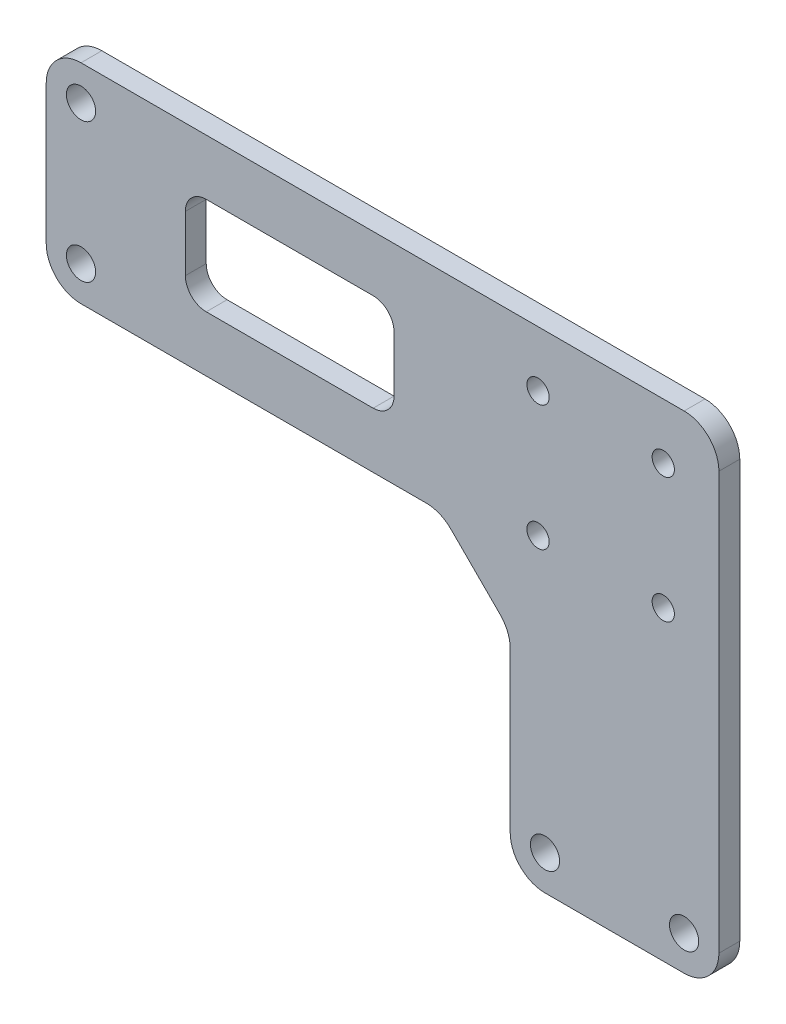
ISO-10303-21;
HEADER;
FILE_DESCRIPTION(('STEP AP214'),'2;1');
FILE_NAME('part.step','',(''),(''),'','','');
FILE_SCHEMA(('AUTOMOTIVE_DESIGN { 1 0 10303 214 1 1 1 1 }'));
ENDSEC;
DATA;
#1=APPLICATION_CONTEXT('core data for automotive mechanical design processes');
#2=APPLICATION_PROTOCOL_DEFINITION('international standard','automotive_design',2000,#1);
#3=PRODUCT_CONTEXT('',#1,'mechanical');
#4=PRODUCT('Part','Part','',(#3));
#5=PRODUCT_RELATED_PRODUCT_CATEGORY('part','',(#4));
#6=PRODUCT_DEFINITION_FORMATION('','',#4);
#7=PRODUCT_DEFINITION_CONTEXT('part definition',#1,'design');
#8=PRODUCT_DEFINITION('design','',#6,#7);
#9=PRODUCT_DEFINITION_SHAPE('','',#8);
#10=(LENGTH_UNIT() NAMED_UNIT(*) SI_UNIT(.MILLI.,.METRE.));
#11=(NAMED_UNIT(*) PLANE_ANGLE_UNIT() SI_UNIT($,.RADIAN.));
#12=(NAMED_UNIT(*) SI_UNIT($,.STERADIAN.) SOLID_ANGLE_UNIT());
#13=UNCERTAINTY_MEASURE_WITH_UNIT(LENGTH_MEASURE(1.E-05),#10,'distance_accuracy_value','');
#14=(GEOMETRIC_REPRESENTATION_CONTEXT(3) GLOBAL_UNCERTAINTY_ASSIGNED_CONTEXT((#13)) GLOBAL_UNIT_ASSIGNED_CONTEXT((#10,
#11,#12)) REPRESENTATION_CONTEXT('',''));
#15=CARTESIAN_POINT('',(0.,0.,0.));
#16=DIRECTION('',(0.,0.,1.));
#17=DIRECTION('',(1.,0.,0.));
#18=AXIS2_PLACEMENT_3D('',#15,#16,#17);
#19=CARTESIAN_POINT('',(0.,0.,3.));
#20=DIRECTION('',(0.,0.,-1.));
#21=DIRECTION('',(-1.,0.,0.));
#22=AXIS2_PLACEMENT_3D('',#19,#20,#21);
#23=PLANE('',#22);
#24=CARTESIAN_POINT('',(88.7000000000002,4.,3.));
#25=DIRECTION('',(0.,0.,1.));
#26=DIRECTION('',(1.,0.,0.));
#27=AXIS2_PLACEMENT_3D('',#24,#25,#26);
#28=CIRCLE('',#27,1.60000000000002);
#29=CARTESIAN_POINT('',(90.3000000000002,4.,3.));
#30=VERTEX_POINT('',#29);
#31=EDGE_CURVE('E330',#30,#30,#28,.T.);
#32=ORIENTED_EDGE('',*,*,#31,.F.);
#33=EDGE_LOOP('',(#32));
#34=FACE_BOUND('',#33,.T.);
#35=CARTESIAN_POINT('',(91.7,-35.0000000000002,3.));
#36=DIRECTION('',(0.,0.,1.));
#37=DIRECTION('',(1.,0.,0.));
#38=AXIS2_PLACEMENT_3D('',#35,#36,#37);
#39=CIRCLE('',#38,2.1);
#40=CARTESIAN_POINT('',(93.8,-35.0000000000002,3.));
#41=VERTEX_POINT('',#40);
#42=EDGE_CURVE('E345',#41,#41,#39,.T.);
#43=ORIENTED_EDGE('',*,*,#42,.F.);
#44=EDGE_LOOP('',(#43));
#45=FACE_BOUND('',#44,.T.);
#46=CARTESIAN_POINT('',(71.7,-35.0000000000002,3.));
#47=DIRECTION('',(0.,0.,1.));
#48=DIRECTION('',(1.,0.,0.));
#49=AXIS2_PLACEMENT_3D('',#46,#47,#48);
#50=CIRCLE('',#49,2.09999999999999);
#51=CARTESIAN_POINT('',(73.8,-35.0000000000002,3.));
#52=VERTEX_POINT('',#51);
#53=EDGE_CURVE('E351',#52,#52,#50,.T.);
#54=ORIENTED_EDGE('',*,*,#53,.F.);
#55=EDGE_LOOP('',(#54));
#56=FACE_BOUND('',#55,.T.);
#57=CARTESIAN_POINT('',(5.,25.,3.));
#58=DIRECTION('',(0.,0.,1.));
#59=DIRECTION('',(1.,0.,0.));
#60=AXIS2_PLACEMENT_3D('',#57,#58,#59);
#61=CIRCLE('',#60,2.1);
#62=CARTESIAN_POINT('',(7.1,25.,3.));
#63=VERTEX_POINT('',#62);
#64=EDGE_CURVE('E357',#63,#63,#61,.T.);
#65=ORIENTED_EDGE('',*,*,#64,.F.);
#66=EDGE_LOOP('',(#65));
#67=FACE_BOUND('',#66,.T.);
#68=CARTESIAN_POINT('',(70.7000000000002,3.99999999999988,3.));
#69=DIRECTION('',(0.,0.,1.));
#70=DIRECTION('',(1.,0.,0.));
#71=AXIS2_PLACEMENT_3D('',#68,#69,#70);
#72=CIRCLE('',#71,1.60000000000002);
#73=CARTESIAN_POINT('',(72.3000000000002,3.99999999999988,3.));
#74=VERTEX_POINT('',#73);
#75=EDGE_CURVE('E363',#74,#74,#72,.T.);
#76=ORIENTED_EDGE('',*,*,#75,.F.);
#77=EDGE_LOOP('',(#76));
#78=FACE_BOUND('',#77,.T.);
#79=CARTESIAN_POINT('',(70.7,21.9999999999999,3.));
#80=DIRECTION('',(0.,0.,1.));
#81=DIRECTION('',(1.,0.,0.));
#82=AXIS2_PLACEMENT_3D('',#79,#80,#81);
#83=CIRCLE('',#82,1.6);
#84=CARTESIAN_POINT('',(72.3,21.9999999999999,3.));
#85=VERTEX_POINT('',#84);
#86=EDGE_CURVE('E369',#85,#85,#83,.T.);
#87=ORIENTED_EDGE('',*,*,#86,.F.);
#88=EDGE_LOOP('',(#87));
#89=FACE_BOUND('',#88,.T.);
#90=CARTESIAN_POINT('',(5.,5.,3.));
#91=DIRECTION('',(0.,0.,1.));
#92=DIRECTION('',(1.,0.,0.));
#93=AXIS2_PLACEMENT_3D('',#90,#91,#92);
#94=CIRCLE('',#93,2.1);
#95=CARTESIAN_POINT('',(7.1,5.,3.));
#96=VERTEX_POINT('',#95);
#97=EDGE_CURVE('E375',#96,#96,#94,.T.);
#98=ORIENTED_EDGE('',*,*,#97,.F.);
#99=EDGE_LOOP('',(#98));
#100=FACE_BOUND('',#99,.T.);
#101=CARTESIAN_POINT('',(88.7,22.,3.));
#102=DIRECTION('',(0.,0.,1.));
#103=DIRECTION('',(1.,0.,0.));
#104=AXIS2_PLACEMENT_3D('',#101,#102,#103);
#105=CIRCLE('',#104,1.60000000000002);
#106=CARTESIAN_POINT('',(90.3,22.,3.));
#107=VERTEX_POINT('',#106);
#108=EDGE_CURVE('E381',#107,#107,#105,.T.);
#109=ORIENTED_EDGE('',*,*,#108,.F.);
#110=EDGE_LOOP('',(#109));
#111=FACE_BOUND('',#110,.T.);
#112=DIRECTION('',(0.,1.,0.));
#113=VECTOR('',#112,1.);
#114=CARTESIAN_POINT('',(96.7,30.,3.));
#115=LINE('',#114,#113);
#116=CARTESIAN_POINT('',(96.7,-35.0000000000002,3.));
#117=VERTEX_POINT('',#116);
#118=CARTESIAN_POINT('',(96.7,25.,3.));
#119=VERTEX_POINT('',#118);
#120=EDGE_CURVE('E398',#117,#119,#115,.T.);
#121=ORIENTED_EDGE('',*,*,#120,.T.);
#122=CARTESIAN_POINT('',(91.7,25.,3.));
#123=DIRECTION('',(0.,0.,-1.));
#124=DIRECTION('',(-1.,0.,0.));
#125=AXIS2_PLACEMENT_3D('',#122,#123,#124);
#126=CIRCLE('',#125,5.);
#127=CARTESIAN_POINT('',(91.7,30.,3.));
#128=VERTEX_POINT('',#127);
#129=EDGE_CURVE('E240',#119,#128,#126,.F.);
#130=ORIENTED_EDGE('',*,*,#129,.T.);
#131=DIRECTION('',(-1.,0.,0.));
#132=VECTOR('',#131,1.);
#133=CARTESIAN_POINT('',(0.,30.,3.));
#134=LINE('',#133,#132);
#135=CARTESIAN_POINT('',(5.,30.,3.));
#136=VERTEX_POINT('',#135);
#137=EDGE_CURVE('E204',#128,#136,#134,.T.);
#138=ORIENTED_EDGE('',*,*,#137,.T.);
#139=CARTESIAN_POINT('',(5.,25.,3.));
#140=DIRECTION('',(0.,0.,-1.));
#141=DIRECTION('',(-1.,0.,0.));
#142=AXIS2_PLACEMENT_3D('',#139,#140,#141);
#143=CIRCLE('',#142,5.);
#144=CARTESIAN_POINT('',(0.,25.,3.));
#145=VERTEX_POINT('',#144);
#146=EDGE_CURVE('E234',#136,#145,#143,.F.);
#147=ORIENTED_EDGE('',*,*,#146,.T.);
#148=DIRECTION('',(0.,-1.,0.));
#149=VECTOR('',#148,1.);
#150=CARTESIAN_POINT('',(0.,0.,3.));
#151=LINE('',#150,#149);
#152=CARTESIAN_POINT('',(0.,5.,3.));
#153=VERTEX_POINT('',#152);
#154=EDGE_CURVE('E222',#145,#153,#151,.T.);
#155=ORIENTED_EDGE('',*,*,#154,.T.);
#156=CARTESIAN_POINT('',(5.,5.,3.));
#157=DIRECTION('',(0.,0.,-1.));
#158=DIRECTION('',(-1.,0.,0.));
#159=AXIS2_PLACEMENT_3D('',#156,#157,#158);
#160=CIRCLE('',#159,5.);
#161=CARTESIAN_POINT('',(5.00000000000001,0.,3.));
#162=VERTEX_POINT('',#161);
#163=EDGE_CURVE('E232',#153,#162,#160,.F.);
#164=ORIENTED_EDGE('',*,*,#163,.T.);
#165=DIRECTION('',(1.,0.,0.));
#166=VECTOR('',#165,1.);
#167=CARTESIAN_POINT('',(56.7,0.,3.));
#168=LINE('',#167,#166);
#169=CARTESIAN_POINT('',(54.6289321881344,0.,3.));
#170=VERTEX_POINT('',#169);
#171=EDGE_CURVE('E216',#162,#170,#168,.T.);
#172=ORIENTED_EDGE('',*,*,#171,.T.);
#173=CARTESIAN_POINT('',(54.6289321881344,-5.,3.));
#174=DIRECTION('',(0.,0.,-1.));
#175=DIRECTION('',(-1.,0.,0.));
#176=AXIS2_PLACEMENT_3D('',#173,#174,#175);
#177=CIRCLE('',#176,5.);
#178=CARTESIAN_POINT('',(58.1644660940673,-1.46446609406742,3.));
#179=VERTEX_POINT('',#178);
#180=EDGE_CURVE('E269',#170,#179,#177,.T.);
#181=ORIENTED_EDGE('',*,*,#180,.T.);
#182=DIRECTION('',(0.707106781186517,-0.707106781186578,0.));
#183=VECTOR('',#182,1.);
#184=CARTESIAN_POINT('',(66.6999999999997,-10.0000000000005,3.));
#185=LINE('',#184,#183);
#186=CARTESIAN_POINT('',(65.2355339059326,-8.53553390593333,3.));
#187=VERTEX_POINT('',#186);
#188=EDGE_CURVE('E389',#179,#187,#185,.T.);
#189=ORIENTED_EDGE('',*,*,#188,.T.);
#190=CARTESIAN_POINT('',(61.6999999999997,-12.0710678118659,3.));
#191=DIRECTION('',(0.,0.,-1.));
#192=DIRECTION('',(-1.,0.,0.));
#193=AXIS2_PLACEMENT_3D('',#190,#191,#192);
#194=CIRCLE('',#193,5.);
#195=CARTESIAN_POINT('',(66.6999999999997,-12.0710678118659,3.));
#196=VERTEX_POINT('',#195);
#197=EDGE_CURVE('E273',#187,#196,#194,.T.);
#198=ORIENTED_EDGE('',*,*,#197,.T.);
#199=DIRECTION('',(0.,-1.,0.));
#200=VECTOR('',#199,1.);
#201=CARTESIAN_POINT('',(66.7,-40.0000000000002,3.));
#202=LINE('',#201,#200);
#203=CARTESIAN_POINT('',(66.7,-35.0000000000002,3.));
#204=VERTEX_POINT('',#203);
#205=EDGE_CURVE('E392',#196,#204,#202,.T.);
#206=ORIENTED_EDGE('',*,*,#205,.T.);
#207=CARTESIAN_POINT('',(71.7,-35.0000000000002,3.));
#208=DIRECTION('',(0.,0.,-1.));
#209=DIRECTION('',(-1.,0.,0.));
#210=AXIS2_PLACEMENT_3D('',#207,#208,#209);
#211=CIRCLE('',#210,5.);
#212=CARTESIAN_POINT('',(71.7,-40.0000000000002,3.));
#213=VERTEX_POINT('',#212);
#214=EDGE_CURVE('E236',#204,#213,#211,.F.);
#215=ORIENTED_EDGE('',*,*,#214,.T.);
#216=DIRECTION('',(1.,0.,0.));
#217=VECTOR('',#216,1.);
#218=CARTESIAN_POINT('',(96.7,-40.0000000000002,3.));
#219=LINE('',#218,#217);
#220=CARTESIAN_POINT('',(91.7,-40.0000000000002,3.));
#221=VERTEX_POINT('',#220);
#222=EDGE_CURVE('E395',#213,#221,#219,.T.);
#223=ORIENTED_EDGE('',*,*,#222,.T.);
#224=CARTESIAN_POINT('',(91.7,-35.0000000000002,3.));
#225=DIRECTION('',(0.,0.,-1.));
#226=DIRECTION('',(-1.,0.,0.));
#227=AXIS2_PLACEMENT_3D('',#224,#225,#226);
#228=CIRCLE('',#227,5.);
#229=EDGE_CURVE('E238',#221,#117,#228,.F.);
#230=ORIENTED_EDGE('',*,*,#229,.T.);
#231=EDGE_LOOP('',(#121,#130,#138,#147,#155,#164,#172,#181,#189,#198,#206,#215,#223,#230));
#232=FACE_BOUND('',#231,.T.);
#233=DIRECTION('',(0.,1.,0.));
#234=VECTOR('',#233,1.);
#235=CARTESIAN_POINT('',(50.,8.,3.));
#236=LINE('',#235,#234);
#237=CARTESIAN_POINT('',(50.,11.,3.));
#238=VERTEX_POINT('',#237);
#239=CARTESIAN_POINT('',(50.,19.,3.));
#240=VERTEX_POINT('',#239);
#241=EDGE_CURVE('E322',#238,#240,#236,.T.);
#242=ORIENTED_EDGE('',*,*,#241,.F.);
#243=CARTESIAN_POINT('',(47.,11.,3.));
#244=DIRECTION('',(0.,0.,-1.));
#245=DIRECTION('',(-1.,0.,0.));
#246=AXIS2_PLACEMENT_3D('',#243,#244,#245);
#247=CIRCLE('',#246,3.);
#248=CARTESIAN_POINT('',(47.,8.,3.));
#249=VERTEX_POINT('',#248);
#250=EDGE_CURVE('E11',#238,#249,#247,.T.);
#251=ORIENTED_EDGE('',*,*,#250,.T.);
#252=DIRECTION('',(1.,0.,0.));
#253=VECTOR('',#252,1.);
#254=CARTESIAN_POINT('',(20.,8.,3.));
#255=LINE('',#254,#253);
#256=CARTESIAN_POINT('',(23.,8.,3.));
#257=VERTEX_POINT('',#256);
#258=EDGE_CURVE('E320',#257,#249,#255,.T.);
#259=ORIENTED_EDGE('',*,*,#258,.F.);
#260=CARTESIAN_POINT('',(23.,11.,3.));
#261=DIRECTION('',(0.,0.,-1.));
#262=DIRECTION('',(-1.,0.,0.));
#263=AXIS2_PLACEMENT_3D('',#260,#261,#262);
#264=CIRCLE('',#263,3.);
#265=CARTESIAN_POINT('',(20.,11.,3.));
#266=VERTEX_POINT('',#265);
#267=EDGE_CURVE('E296',#257,#266,#264,.T.);
#268=ORIENTED_EDGE('',*,*,#267,.T.);
#269=DIRECTION('',(0.,-1.,0.));
#270=VECTOR('',#269,1.);
#271=CARTESIAN_POINT('',(20.,8.,3.));
#272=LINE('',#271,#270);
#273=CARTESIAN_POINT('',(20.,19.,3.));
#274=VERTEX_POINT('',#273);
#275=EDGE_CURVE('E327',#274,#266,#272,.T.);
#276=ORIENTED_EDGE('',*,*,#275,.F.);
#277=CARTESIAN_POINT('',(23.,19.,3.));
#278=DIRECTION('',(0.,0.,-1.));
#279=DIRECTION('',(-1.,0.,0.));
#280=AXIS2_PLACEMENT_3D('',#277,#278,#279);
#281=CIRCLE('',#280,3.);
#282=CARTESIAN_POINT('',(23.,22.,3.));
#283=VERTEX_POINT('',#282);
#284=EDGE_CURVE('E300',#274,#283,#281,.T.);
#285=ORIENTED_EDGE('',*,*,#284,.T.);
#286=DIRECTION('',(-1.,0.,0.));
#287=VECTOR('',#286,1.);
#288=CARTESIAN_POINT('',(20.,22.,3.));
#289=LINE('',#288,#287);
#290=CARTESIAN_POINT('',(47.,22.,3.));
#291=VERTEX_POINT('',#290);
#292=EDGE_CURVE('E333',#291,#283,#289,.T.);
#293=ORIENTED_EDGE('',*,*,#292,.F.);
#294=CARTESIAN_POINT('',(47.,19.,3.));
#295=DIRECTION('',(0.,0.,-1.));
#296=DIRECTION('',(-1.,0.,0.));
#297=AXIS2_PLACEMENT_3D('',#294,#295,#296);
#298=CIRCLE('',#297,3.);
#299=EDGE_CURVE('E49',#291,#240,#298,.T.);
#300=ORIENTED_EDGE('',*,*,#299,.T.);
#301=EDGE_LOOP('',(#242,#251,#259,#268,#276,#285,#293,#300));
#302=FACE_BOUND('',#301,.T.);
#303=ADVANCED_FACE('F34',(#34,#45,#56,#67,#78,#89,#100,#111,#232,#302),#23,.F.);
#304=CARTESIAN_POINT('',(0.,0.,0.));
#305=DIRECTION('',(0.,0.,-1.));
#306=DIRECTION('',(-1.,0.,0.));
#307=AXIS2_PLACEMENT_3D('',#304,#305,#306);
#308=PLANE('',#307);
#309=CARTESIAN_POINT('',(91.7,-35.0000000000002,0.));
#310=DIRECTION('',(0.,0.,1.));
#311=DIRECTION('',(1.,0.,0.));
#312=AXIS2_PLACEMENT_3D('',#309,#310,#311);
#313=CIRCLE('',#312,2.1);
#314=CARTESIAN_POINT('',(93.8,-35.0000000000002,0.));
#315=VERTEX_POINT('',#314);
#316=EDGE_CURVE('E343',#315,#315,#313,.T.);
#317=ORIENTED_EDGE('',*,*,#316,.T.);
#318=EDGE_LOOP('',(#317));
#319=FACE_BOUND('',#318,.T.);
#320=CARTESIAN_POINT('',(5.,25.,0.));
#321=DIRECTION('',(0.,0.,1.));
#322=DIRECTION('',(1.,0.,0.));
#323=AXIS2_PLACEMENT_3D('',#320,#321,#322);
#324=CIRCLE('',#323,2.1);
#325=CARTESIAN_POINT('',(7.1,25.,0.));
#326=VERTEX_POINT('',#325);
#327=EDGE_CURVE('E354',#326,#326,#324,.T.);
#328=ORIENTED_EDGE('',*,*,#327,.T.);
#329=EDGE_LOOP('',(#328));
#330=FACE_BOUND('',#329,.T.);
#331=CARTESIAN_POINT('',(70.7,21.9999999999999,0.));
#332=DIRECTION('',(0.,0.,1.));
#333=DIRECTION('',(1.,0.,0.));
#334=AXIS2_PLACEMENT_3D('',#331,#332,#333);
#335=CIRCLE('',#334,1.6);
#336=CARTESIAN_POINT('',(72.3,21.9999999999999,0.));
#337=VERTEX_POINT('',#336);
#338=EDGE_CURVE('E366',#337,#337,#335,.T.);
#339=ORIENTED_EDGE('',*,*,#338,.T.);
#340=EDGE_LOOP('',(#339));
#341=FACE_BOUND('',#340,.T.);
#342=CARTESIAN_POINT('',(88.7,22.,0.));
#343=DIRECTION('',(0.,0.,1.));
#344=DIRECTION('',(1.,0.,0.));
#345=AXIS2_PLACEMENT_3D('',#342,#343,#344);
#346=CIRCLE('',#345,1.60000000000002);
#347=CARTESIAN_POINT('',(90.3,22.,0.));
#348=VERTEX_POINT('',#347);
#349=EDGE_CURVE('E378',#348,#348,#346,.T.);
#350=ORIENTED_EDGE('',*,*,#349,.T.);
#351=EDGE_LOOP('',(#350));
#352=FACE_BOUND('',#351,.T.);
#353=DIRECTION('',(-1.,0.,0.));
#354=VECTOR('',#353,1.);
#355=CARTESIAN_POINT('',(0.,30.,0.));
#356=LINE('',#355,#354);
#357=CARTESIAN_POINT('',(91.7,30.,0.));
#358=VERTEX_POINT('',#357);
#359=CARTESIAN_POINT('',(5.,30.,0.));
#360=VERTEX_POINT('',#359);
#361=EDGE_CURVE('E201',#358,#360,#356,.T.);
#362=ORIENTED_EDGE('',*,*,#361,.F.);
#363=CARTESIAN_POINT('',(91.7,25.,0.));
#364=DIRECTION('',(0.,0.,-1.));
#365=DIRECTION('',(-1.,0.,0.));
#366=AXIS2_PLACEMENT_3D('',#363,#364,#365);
#367=CIRCLE('',#366,5.);
#368=CARTESIAN_POINT('',(96.7,25.,0.));
#369=VERTEX_POINT('',#368);
#370=EDGE_CURVE('E184',#358,#369,#367,.T.);
#371=ORIENTED_EDGE('',*,*,#370,.T.);
#372=DIRECTION('',(0.,1.,0.));
#373=VECTOR('',#372,1.);
#374=CARTESIAN_POINT('',(96.7,30.,0.));
#375=LINE('',#374,#373);
#376=CARTESIAN_POINT('',(96.7,-35.0000000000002,0.));
#377=VERTEX_POINT('',#376);
#378=EDGE_CURVE('E213',#377,#369,#375,.T.);
#379=ORIENTED_EDGE('',*,*,#378,.F.);
#380=CARTESIAN_POINT('',(91.7,-35.0000000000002,0.));
#381=DIRECTION('',(0.,0.,-1.));
#382=DIRECTION('',(-1.,0.,0.));
#383=AXIS2_PLACEMENT_3D('',#380,#381,#382);
#384=CIRCLE('',#383,5.);
#385=CARTESIAN_POINT('',(91.7,-40.0000000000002,0.));
#386=VERTEX_POINT('',#385);
#387=EDGE_CURVE('E195',#377,#386,#384,.T.);
#388=ORIENTED_EDGE('',*,*,#387,.T.);
#389=DIRECTION('',(1.,0.,0.));
#390=VECTOR('',#389,1.);
#391=CARTESIAN_POINT('',(96.7,-40.0000000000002,0.));
#392=LINE('',#391,#390);
#393=CARTESIAN_POINT('',(71.7,-40.0000000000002,0.));
#394=VERTEX_POINT('',#393);
#395=EDGE_CURVE('E218',#394,#386,#392,.T.);
#396=ORIENTED_EDGE('',*,*,#395,.F.);
#397=CARTESIAN_POINT('',(71.7,-35.0000000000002,0.));
#398=DIRECTION('',(0.,0.,-1.));
#399=DIRECTION('',(-1.,0.,0.));
#400=AXIS2_PLACEMENT_3D('',#397,#398,#399);
#401=CIRCLE('',#400,5.);
#402=CARTESIAN_POINT('',(66.7,-35.0000000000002,0.));
#403=VERTEX_POINT('',#402);
#404=EDGE_CURVE('E226',#394,#403,#401,.T.);
#405=ORIENTED_EDGE('',*,*,#404,.T.);
#406=DIRECTION('',(0.,-1.,0.));
#407=VECTOR('',#406,1.);
#408=CARTESIAN_POINT('',(66.7,-40.0000000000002,0.));
#409=LINE('',#408,#407);
#410=CARTESIAN_POINT('',(66.6999999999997,-12.0710678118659,0.));
#411=VERTEX_POINT('',#410);
#412=EDGE_CURVE('E409',#411,#403,#409,.T.);
#413=ORIENTED_EDGE('',*,*,#412,.F.);
#414=CARTESIAN_POINT('',(61.6999999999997,-12.0710678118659,0.));
#415=DIRECTION('',(0.,0.,-1.));
#416=DIRECTION('',(-1.,0.,0.));
#417=AXIS2_PLACEMENT_3D('',#414,#415,#416);
#418=CIRCLE('',#417,5.);
#419=CARTESIAN_POINT('',(65.2355339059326,-8.53553390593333,0.));
#420=VERTEX_POINT('',#419);
#421=EDGE_CURVE('E271',#411,#420,#418,.F.);
#422=ORIENTED_EDGE('',*,*,#421,.T.);
#423=DIRECTION('',(0.707106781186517,-0.707106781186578,0.));
#424=VECTOR('',#423,1.);
#425=CARTESIAN_POINT('',(66.6999999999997,-10.0000000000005,0.));
#426=LINE('',#425,#424);
#427=CARTESIAN_POINT('',(58.1644660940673,-1.46446609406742,0.));
#428=VERTEX_POINT('',#427);
#429=EDGE_CURVE('E406',#428,#420,#426,.T.);
#430=ORIENTED_EDGE('',*,*,#429,.F.);
#431=CARTESIAN_POINT('',(54.6289321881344,-5.,0.));
#432=DIRECTION('',(0.,0.,-1.));
#433=DIRECTION('',(-1.,0.,0.));
#434=AXIS2_PLACEMENT_3D('',#431,#432,#433);
#435=CIRCLE('',#434,5.);
#436=CARTESIAN_POINT('',(54.6289321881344,0.,0.));
#437=VERTEX_POINT('',#436);
#438=EDGE_CURVE('E267',#428,#437,#435,.F.);
#439=ORIENTED_EDGE('',*,*,#438,.T.);
#440=DIRECTION('',(1.,0.,0.));
#441=VECTOR('',#440,1.);
#442=CARTESIAN_POINT('',(56.7,0.,0.));
#443=LINE('',#442,#441);
#444=CARTESIAN_POINT('',(5.00000000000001,0.,0.));
#445=VERTEX_POINT('',#444);
#446=EDGE_CURVE('E384',#445,#437,#443,.T.);
#447=ORIENTED_EDGE('',*,*,#446,.F.);
#448=CARTESIAN_POINT('',(5.,5.,0.));
#449=DIRECTION('',(0.,0.,-1.));
#450=DIRECTION('',(-1.,0.,0.));
#451=AXIS2_PLACEMENT_3D('',#448,#449,#450);
#452=CIRCLE('',#451,5.);
#453=CARTESIAN_POINT('',(0.,5.,0.));
#454=VERTEX_POINT('',#453);
#455=EDGE_CURVE('E205',#445,#454,#452,.T.);
#456=ORIENTED_EDGE('',*,*,#455,.T.);
#457=DIRECTION('',(0.,-1.,0.));
#458=VECTOR('',#457,1.);
#459=CARTESIAN_POINT('',(0.,0.,0.));
#460=LINE('',#459,#458);
#461=CARTESIAN_POINT('',(0.,25.,0.));
#462=VERTEX_POINT('',#461);
#463=EDGE_CURVE('E212',#462,#454,#460,.T.);
#464=ORIENTED_EDGE('',*,*,#463,.F.);
#465=CARTESIAN_POINT('',(5.,25.,0.));
#466=DIRECTION('',(0.,0.,-1.));
#467=DIRECTION('',(-1.,0.,0.));
#468=AXIS2_PLACEMENT_3D('',#465,#466,#467);
#469=CIRCLE('',#468,5.);
#470=EDGE_CURVE('E211',#462,#360,#469,.T.);
#471=ORIENTED_EDGE('',*,*,#470,.T.);
#472=EDGE_LOOP('',(#362,#371,#379,#388,#396,#405,#413,#422,#430,#439,#447,#456,#464,#471));
#473=FACE_BOUND('',#472,.T.);
#474=CARTESIAN_POINT('',(5.,5.,0.));
#475=DIRECTION('',(0.,0.,1.));
#476=DIRECTION('',(1.,0.,0.));
#477=AXIS2_PLACEMENT_3D('',#474,#475,#476);
#478=CIRCLE('',#477,2.1);
#479=CARTESIAN_POINT('',(7.1,5.,0.));
#480=VERTEX_POINT('',#479);
#481=EDGE_CURVE('E372',#480,#480,#478,.T.);
#482=ORIENTED_EDGE('',*,*,#481,.T.);
#483=EDGE_LOOP('',(#482));
#484=FACE_BOUND('',#483,.T.);
#485=CARTESIAN_POINT('',(70.7000000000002,3.99999999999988,0.));
#486=DIRECTION('',(0.,0.,1.));
#487=DIRECTION('',(1.,0.,0.));
#488=AXIS2_PLACEMENT_3D('',#485,#486,#487);
#489=CIRCLE('',#488,1.60000000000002);
#490=CARTESIAN_POINT('',(72.3000000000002,3.99999999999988,0.));
#491=VERTEX_POINT('',#490);
#492=EDGE_CURVE('E360',#491,#491,#489,.T.);
#493=ORIENTED_EDGE('',*,*,#492,.T.);
#494=EDGE_LOOP('',(#493));
#495=FACE_BOUND('',#494,.T.);
#496=CARTESIAN_POINT('',(71.7,-35.0000000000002,0.));
#497=DIRECTION('',(0.,0.,1.));
#498=DIRECTION('',(1.,0.,0.));
#499=AXIS2_PLACEMENT_3D('',#496,#497,#498);
#500=CIRCLE('',#499,2.09999999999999);
#501=CARTESIAN_POINT('',(73.8,-35.0000000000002,0.));
#502=VERTEX_POINT('',#501);
#503=EDGE_CURVE('E348',#502,#502,#500,.T.);
#504=ORIENTED_EDGE('',*,*,#503,.T.);
#505=EDGE_LOOP('',(#504));
#506=FACE_BOUND('',#505,.T.);
#507=CARTESIAN_POINT('',(88.7000000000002,4.,0.));
#508=DIRECTION('',(0.,0.,1.));
#509=DIRECTION('',(1.,0.,0.));
#510=AXIS2_PLACEMENT_3D('',#507,#508,#509);
#511=CIRCLE('',#510,1.60000000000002);
#512=CARTESIAN_POINT('',(90.3000000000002,4.,0.));
#513=VERTEX_POINT('',#512);
#514=EDGE_CURVE('E326',#513,#513,#511,.T.);
#515=ORIENTED_EDGE('',*,*,#514,.T.);
#516=EDGE_LOOP('',(#515));
#517=FACE_BOUND('',#516,.T.);
#518=DIRECTION('',(0.,-1.,0.));
#519=VECTOR('',#518,1.);
#520=CARTESIAN_POINT('',(20.,8.,0.));
#521=LINE('',#520,#519);
#522=CARTESIAN_POINT('',(20.,19.,0.));
#523=VERTEX_POINT('',#522);
#524=CARTESIAN_POINT('',(20.,11.,0.));
#525=VERTEX_POINT('',#524);
#526=EDGE_CURVE('E339',#523,#525,#521,.T.);
#527=ORIENTED_EDGE('',*,*,#526,.T.);
#528=CARTESIAN_POINT('',(23.,11.,0.));
#529=DIRECTION('',(0.,0.,-1.));
#530=DIRECTION('',(-1.,0.,0.));
#531=AXIS2_PLACEMENT_3D('',#528,#529,#530);
#532=CIRCLE('',#531,3.);
#533=CARTESIAN_POINT('',(23.,8.,0.));
#534=VERTEX_POINT('',#533);
#535=EDGE_CURVE('E294',#525,#534,#532,.F.);
#536=ORIENTED_EDGE('',*,*,#535,.T.);
#537=DIRECTION('',(1.,0.,0.));
#538=VECTOR('',#537,1.);
#539=CARTESIAN_POINT('',(20.,8.,0.));
#540=LINE('',#539,#538);
#541=CARTESIAN_POINT('',(47.,8.,0.));
#542=VERTEX_POINT('',#541);
#543=EDGE_CURVE('E310',#534,#542,#540,.T.);
#544=ORIENTED_EDGE('',*,*,#543,.T.);
#545=CARTESIAN_POINT('',(47.,11.,0.));
#546=DIRECTION('',(0.,0.,-1.));
#547=DIRECTION('',(-1.,0.,0.));
#548=AXIS2_PLACEMENT_3D('',#545,#546,#547);
#549=CIRCLE('',#548,3.);
#550=CARTESIAN_POINT('',(50.,11.,0.));
#551=VERTEX_POINT('',#550);
#552=EDGE_CURVE('E42',#542,#551,#549,.F.);
#553=ORIENTED_EDGE('',*,*,#552,.T.);
#554=DIRECTION('',(0.,1.,0.));
#555=VECTOR('',#554,1.);
#556=CARTESIAN_POINT('',(50.,8.,0.));
#557=LINE('',#556,#555);
#558=CARTESIAN_POINT('',(50.,19.,0.));
#559=VERTEX_POINT('',#558);
#560=EDGE_CURVE('E308',#551,#559,#557,.T.);
#561=ORIENTED_EDGE('',*,*,#560,.T.);
#562=CARTESIAN_POINT('',(47.,19.,0.));
#563=DIRECTION('',(0.,0.,-1.));
#564=DIRECTION('',(-1.,0.,0.));
#565=AXIS2_PLACEMENT_3D('',#562,#563,#564);
#566=CIRCLE('',#565,3.);
#567=CARTESIAN_POINT('',(47.,22.,0.));
#568=VERTEX_POINT('',#567);
#569=EDGE_CURVE('E302',#559,#568,#566,.F.);
#570=ORIENTED_EDGE('',*,*,#569,.T.);
#571=DIRECTION('',(-1.,0.,0.));
#572=VECTOR('',#571,1.);
#573=CARTESIAN_POINT('',(20.,22.,0.));
#574=LINE('',#573,#572);
#575=CARTESIAN_POINT('',(23.,22.,0.));
#576=VERTEX_POINT('',#575);
#577=EDGE_CURVE('E315',#568,#576,#574,.T.);
#578=ORIENTED_EDGE('',*,*,#577,.T.);
#579=CARTESIAN_POINT('',(23.,19.,0.));
#580=DIRECTION('',(0.,0.,-1.));
#581=DIRECTION('',(-1.,0.,0.));
#582=AXIS2_PLACEMENT_3D('',#579,#580,#581);
#583=CIRCLE('',#582,3.);
#584=EDGE_CURVE('E298',#576,#523,#583,.F.);
#585=ORIENTED_EDGE('',*,*,#584,.T.);
#586=EDGE_LOOP('',(#527,#536,#544,#553,#561,#570,#578,#585));
#587=FACE_BOUND('',#586,.T.);
#588=ADVANCED_FACE('F208',(#319,#330,#341,#352,#473,#484,#495,#506,#517,#587),#308,.T.);
#589=CARTESIAN_POINT('',(56.7,0.,3.));
#590=DIRECTION('',(0.,1.,0.));
#591=DIRECTION('',(-1.,0.,0.));
#592=AXIS2_PLACEMENT_3D('',#589,#590,#591);
#593=PLANE('',#592);
#594=ORIENTED_EDGE('',*,*,#446,.T.);
#595=DIRECTION('',(0.,0.,-1.));
#596=VECTOR('',#595,1.);
#597=CARTESIAN_POINT('',(54.6289321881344,0.,3.));
#598=LINE('',#597,#596);
#599=EDGE_CURVE('E260',#437,#170,#598,.F.);
#600=ORIENTED_EDGE('',*,*,#599,.T.);
#601=ORIENTED_EDGE('',*,*,#171,.F.);
#602=DIRECTION('',(0.,0.,-1.));
#603=VECTOR('',#602,1.);
#604=CARTESIAN_POINT('',(5.,0.,3.));
#605=LINE('',#604,#603);
#606=EDGE_CURVE('E257',#162,#445,#605,.T.);
#607=ORIENTED_EDGE('',*,*,#606,.T.);
#608=EDGE_LOOP('',(#594,#600,#601,#607));
#609=FACE_BOUND('',#608,.T.);
#610=ADVANCED_FACE('F442',(#609),#593,.F.);
#611=CARTESIAN_POINT('',(66.6999999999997,-10.0000000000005,3.));
#612=DIRECTION('',(0.707106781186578,0.707106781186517,0.));
#613=DIRECTION('',(-0.707106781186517,0.707106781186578,0.));
#614=AXIS2_PLACEMENT_3D('',#611,#612,#613);
#615=PLANE('',#614);
#616=ORIENTED_EDGE('',*,*,#188,.F.);
#617=DIRECTION('',(0.,0.,-1.));
#618=VECTOR('',#617,1.);
#619=CARTESIAN_POINT('',(58.1644660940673,-1.46446609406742,0.));
#620=LINE('',#619,#618);
#621=EDGE_CURVE('E254',#179,#428,#620,.T.);
#622=ORIENTED_EDGE('',*,*,#621,.T.);
#623=ORIENTED_EDGE('',*,*,#429,.T.);
#624=DIRECTION('',(0.,0.,-1.));
#625=VECTOR('',#624,1.);
#626=CARTESIAN_POINT('',(65.2355339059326,-8.53553390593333,3.));
#627=LINE('',#626,#625);
#628=EDGE_CURVE('E252',#420,#187,#627,.F.);
#629=ORIENTED_EDGE('',*,*,#628,.T.);
#630=EDGE_LOOP('',(#616,#622,#623,#629));
#631=FACE_BOUND('',#630,.T.);
#632=ADVANCED_FACE('F659',(#631),#615,.F.);
#633=CARTESIAN_POINT('',(66.7,-40.0000000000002,3.));
#634=DIRECTION('',(1.,0.,0.));
#635=DIRECTION('',(0.,1.,0.));
#636=AXIS2_PLACEMENT_3D('',#633,#634,#635);
#637=PLANE('',#636);
#638=ORIENTED_EDGE('',*,*,#412,.T.);
#639=DIRECTION('',(0.,0.,-1.));
#640=VECTOR('',#639,1.);
#641=CARTESIAN_POINT('',(66.7,-35.0000000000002,3.));
#642=LINE('',#641,#640);
#643=EDGE_CURVE('E250',#403,#204,#642,.F.);
#644=ORIENTED_EDGE('',*,*,#643,.T.);
#645=ORIENTED_EDGE('',*,*,#205,.F.);
#646=DIRECTION('',(0.,0.,-1.));
#647=VECTOR('',#646,1.);
#648=CARTESIAN_POINT('',(66.6999999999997,-12.0710678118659,0.));
#649=LINE('',#648,#647);
#650=EDGE_CURVE('E247',#196,#411,#649,.T.);
#651=ORIENTED_EDGE('',*,*,#650,.T.);
#652=EDGE_LOOP('',(#638,#644,#645,#651));
#653=FACE_BOUND('',#652,.T.);
#654=ADVANCED_FACE('F434',(#653),#637,.F.);
#655=CARTESIAN_POINT('',(96.7,-40.0000000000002,3.));
#656=DIRECTION('',(0.,1.,0.));
#657=DIRECTION('',(-1.,0.,0.));
#658=AXIS2_PLACEMENT_3D('',#655,#656,#657);
#659=PLANE('',#658);
#660=ORIENTED_EDGE('',*,*,#395,.T.);
#661=DIRECTION('',(0.,0.,-1.));
#662=VECTOR('',#661,1.);
#663=CARTESIAN_POINT('',(91.7,-40.0000000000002,3.));
#664=LINE('',#663,#662);
#665=EDGE_CURVE('E245',#386,#221,#664,.F.);
#666=ORIENTED_EDGE('',*,*,#665,.T.);
#667=ORIENTED_EDGE('',*,*,#222,.F.);
#668=DIRECTION('',(0.,0.,-1.));
#669=VECTOR('',#668,1.);
#670=CARTESIAN_POINT('',(71.7,-40.0000000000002,3.));
#671=LINE('',#670,#669);
#672=EDGE_CURVE('E242',#213,#394,#671,.T.);
#673=ORIENTED_EDGE('',*,*,#672,.T.);
#674=EDGE_LOOP('',(#660,#666,#667,#673));
#675=FACE_BOUND('',#674,.T.);
#676=ADVANCED_FACE('F415',(#675),#659,.F.);
#677=CARTESIAN_POINT('',(96.7,30.,3.));
#678=DIRECTION('',(-1.,0.,0.));
#679=DIRECTION('',(0.,0.,1.));
#680=AXIS2_PLACEMENT_3D('',#677,#678,#679);
#681=PLANE('',#680);
#682=ORIENTED_EDGE('',*,*,#378,.T.);
#683=DIRECTION('',(0.,0.,-1.));
#684=VECTOR('',#683,1.);
#685=CARTESIAN_POINT('',(96.7,25.,3.));
#686=LINE('',#685,#684);
#687=EDGE_CURVE('E189',#369,#119,#686,.F.);
#688=ORIENTED_EDGE('',*,*,#687,.T.);
#689=ORIENTED_EDGE('',*,*,#120,.F.);
#690=DIRECTION('',(0.,0.,-1.));
#691=VECTOR('',#690,1.);
#692=CARTESIAN_POINT('',(96.7,-35.0000000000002,3.));
#693=LINE('',#692,#691);
#694=EDGE_CURVE('E194',#117,#377,#693,.T.);
#695=ORIENTED_EDGE('',*,*,#694,.T.);
#696=EDGE_LOOP('',(#682,#688,#689,#695));
#697=FACE_BOUND('',#696,.T.);
#698=ADVANCED_FACE('F425',(#697),#681,.F.);
#699=CARTESIAN_POINT('',(0.,30.,3.));
#700=DIRECTION('',(0.,-1.,0.));
#701=DIRECTION('',(0.,0.,-1.));
#702=AXIS2_PLACEMENT_3D('',#699,#700,#701);
#703=PLANE('',#702);
#704=ORIENTED_EDGE('',*,*,#137,.F.);
#705=DIRECTION('',(0.,0.,-1.));
#706=VECTOR('',#705,1.);
#707=CARTESIAN_POINT('',(91.7,30.,3.));
#708=LINE('',#707,#706);
#709=EDGE_CURVE('E188',#128,#358,#708,.T.);
#710=ORIENTED_EDGE('',*,*,#709,.T.);
#711=ORIENTED_EDGE('',*,*,#361,.T.);
#712=DIRECTION('',(0.,0.,-1.));
#713=VECTOR('',#712,1.);
#714=CARTESIAN_POINT('',(5.,30.,3.));
#715=LINE('',#714,#713);
#716=EDGE_CURVE('E206',#360,#136,#715,.F.);
#717=ORIENTED_EDGE('',*,*,#716,.T.);
#718=EDGE_LOOP('',(#704,#710,#711,#717));
#719=FACE_BOUND('',#718,.T.);
#720=ADVANCED_FACE('F200',(#719),#703,.F.);
#721=CARTESIAN_POINT('',(0.,0.,3.));
#722=DIRECTION('',(1.,0.,0.));
#723=DIRECTION('',(0.,0.,-1.));
#724=AXIS2_PLACEMENT_3D('',#721,#722,#723);
#725=PLANE('',#724);
#726=ORIENTED_EDGE('',*,*,#154,.F.);
#727=DIRECTION('',(0.,0.,-1.));
#728=VECTOR('',#727,1.);
#729=CARTESIAN_POINT('',(0.,25.,3.));
#730=LINE('',#729,#728);
#731=EDGE_CURVE('E264',#145,#462,#730,.T.);
#732=ORIENTED_EDGE('',*,*,#731,.T.);
#733=ORIENTED_EDGE('',*,*,#463,.T.);
#734=DIRECTION('',(0.,0.,-1.));
#735=VECTOR('',#734,1.);
#736=CARTESIAN_POINT('',(0.,5.,3.));
#737=LINE('',#736,#735);
#738=EDGE_CURVE('E262',#454,#153,#737,.F.);
#739=ORIENTED_EDGE('',*,*,#738,.T.);
#740=EDGE_LOOP('',(#726,#732,#733,#739));
#741=FACE_BOUND('',#740,.T.);
#742=ADVANCED_FACE('F432',(#741),#725,.F.);
#743=CARTESIAN_POINT('',(88.7,22.,3.));
#744=DIRECTION('',(0.,0.,-1.));
#745=DIRECTION('',(-1.,0.,0.));
#746=AXIS2_PLACEMENT_3D('',#743,#744,#745);
#747=CYLINDRICAL_SURFACE('',#746,1.60000000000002);
#748=ORIENTED_EDGE('',*,*,#108,.T.);
#749=EDGE_LOOP('',(#748));
#750=FACE_BOUND('',#749,.T.);
#751=ORIENTED_EDGE('',*,*,#349,.F.);
#752=EDGE_LOOP('',(#751));
#753=FACE_BOUND('',#752,.T.);
#754=ADVANCED_FACE('F448',(#750,#753),#747,.F.);
#755=CARTESIAN_POINT('',(5.,5.,3.));
#756=DIRECTION('',(0.,0.,-1.));
#757=DIRECTION('',(-1.,0.,0.));
#758=AXIS2_PLACEMENT_3D('',#755,#756,#757);
#759=CYLINDRICAL_SURFACE('',#758,2.1);
#760=ORIENTED_EDGE('',*,*,#97,.T.);
#761=EDGE_LOOP('',(#760));
#762=FACE_BOUND('',#761,.T.);
#763=ORIENTED_EDGE('',*,*,#481,.F.);
#764=EDGE_LOOP('',(#763));
#765=FACE_BOUND('',#764,.T.);
#766=ADVANCED_FACE('F456',(#762,#765),#759,.F.);
#767=CARTESIAN_POINT('',(70.7,21.9999999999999,3.));
#768=DIRECTION('',(0.,0.,-1.));
#769=DIRECTION('',(-1.,0.,0.));
#770=AXIS2_PLACEMENT_3D('',#767,#768,#769);
#771=CYLINDRICAL_SURFACE('',#770,1.6);
#772=ORIENTED_EDGE('',*,*,#86,.T.);
#773=EDGE_LOOP('',(#772));
#774=FACE_BOUND('',#773,.T.);
#775=ORIENTED_EDGE('',*,*,#338,.F.);
#776=EDGE_LOOP('',(#775));
#777=FACE_BOUND('',#776,.T.);
#778=ADVANCED_FACE('F537',(#774,#777),#771,.F.);
#779=CARTESIAN_POINT('',(70.7000000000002,3.99999999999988,3.));
#780=DIRECTION('',(0.,0.,-1.));
#781=DIRECTION('',(-1.,0.,0.));
#782=AXIS2_PLACEMENT_3D('',#779,#780,#781);
#783=CYLINDRICAL_SURFACE('',#782,1.60000000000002);
#784=ORIENTED_EDGE('',*,*,#75,.T.);
#785=EDGE_LOOP('',(#784));
#786=FACE_BOUND('',#785,.T.);
#787=ORIENTED_EDGE('',*,*,#492,.F.);
#788=EDGE_LOOP('',(#787));
#789=FACE_BOUND('',#788,.T.);
#790=ADVANCED_FACE('F533',(#786,#789),#783,.F.);
#791=CARTESIAN_POINT('',(5.,25.,3.));
#792=DIRECTION('',(0.,0.,-1.));
#793=DIRECTION('',(-1.,0.,0.));
#794=AXIS2_PLACEMENT_3D('',#791,#792,#793);
#795=CYLINDRICAL_SURFACE('',#794,2.1);
#796=ORIENTED_EDGE('',*,*,#64,.T.);
#797=EDGE_LOOP('',(#796));
#798=FACE_BOUND('',#797,.T.);
#799=ORIENTED_EDGE('',*,*,#327,.F.);
#800=EDGE_LOOP('',(#799));
#801=FACE_BOUND('',#800,.T.);
#802=ADVANCED_FACE('F529',(#798,#801),#795,.F.);
#803=CARTESIAN_POINT('',(71.7,-35.0000000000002,3.));
#804=DIRECTION('',(0.,0.,-1.));
#805=DIRECTION('',(-1.,0.,0.));
#806=AXIS2_PLACEMENT_3D('',#803,#804,#805);
#807=CYLINDRICAL_SURFACE('',#806,2.09999999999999);
#808=ORIENTED_EDGE('',*,*,#53,.T.);
#809=EDGE_LOOP('',(#808));
#810=FACE_BOUND('',#809,.T.);
#811=ORIENTED_EDGE('',*,*,#503,.F.);
#812=EDGE_LOOP('',(#811));
#813=FACE_BOUND('',#812,.T.);
#814=ADVANCED_FACE('F525',(#810,#813),#807,.F.);
#815=CARTESIAN_POINT('',(91.7,-35.0000000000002,3.));
#816=DIRECTION('',(0.,0.,-1.));
#817=DIRECTION('',(-1.,0.,0.));
#818=AXIS2_PLACEMENT_3D('',#815,#816,#817);
#819=CYLINDRICAL_SURFACE('',#818,2.1);
#820=ORIENTED_EDGE('',*,*,#42,.T.);
#821=EDGE_LOOP('',(#820));
#822=FACE_BOUND('',#821,.T.);
#823=ORIENTED_EDGE('',*,*,#316,.F.);
#824=EDGE_LOOP('',(#823));
#825=FACE_BOUND('',#824,.T.);
#826=ADVANCED_FACE('F521',(#822,#825),#819,.F.);
#827=CARTESIAN_POINT('',(88.7000000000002,4.,3.));
#828=DIRECTION('',(0.,0.,-1.));
#829=DIRECTION('',(-1.,0.,0.));
#830=AXIS2_PLACEMENT_3D('',#827,#828,#829);
#831=CYLINDRICAL_SURFACE('',#830,1.60000000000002);
#832=ORIENTED_EDGE('',*,*,#31,.T.);
#833=EDGE_LOOP('',(#832));
#834=FACE_BOUND('',#833,.T.);
#835=ORIENTED_EDGE('',*,*,#514,.F.);
#836=EDGE_LOOP('',(#835));
#837=FACE_BOUND('',#836,.T.);
#838=ADVANCED_FACE('F518',(#834,#837),#831,.F.);
#839=CARTESIAN_POINT('',(50.,8.,3.));
#840=DIRECTION('',(-1.,0.,0.));
#841=DIRECTION('',(0.,0.,1.));
#842=AXIS2_PLACEMENT_3D('',#839,#840,#841);
#843=PLANE('',#842);
#844=ORIENTED_EDGE('',*,*,#241,.T.);
#845=DIRECTION('',(0.,0.,-1.));
#846=VECTOR('',#845,1.);
#847=CARTESIAN_POINT('',(50.,19.,0.));
#848=LINE('',#847,#846);
#849=EDGE_CURVE('E291',#240,#559,#848,.T.);
#850=ORIENTED_EDGE('',*,*,#849,.T.);
#851=ORIENTED_EDGE('',*,*,#560,.F.);
#852=DIRECTION('',(0.,0.,-1.));
#853=VECTOR('',#852,1.);
#854=CARTESIAN_POINT('',(50.,11.,3.));
#855=LINE('',#854,#853);
#856=EDGE_CURVE('E56',#551,#238,#855,.F.);
#857=ORIENTED_EDGE('',*,*,#856,.T.);
#858=EDGE_LOOP('',(#844,#850,#851,#857));
#859=FACE_BOUND('',#858,.T.);
#860=ADVANCED_FACE('F313',(#859),#843,.T.);
#861=CARTESIAN_POINT('',(20.,22.,3.));
#862=DIRECTION('',(0.,-1.,0.));
#863=DIRECTION('',(0.,0.,-1.));
#864=AXIS2_PLACEMENT_3D('',#861,#862,#863);
#865=PLANE('',#864);
#866=ORIENTED_EDGE('',*,*,#292,.T.);
#867=DIRECTION('',(0.,0.,-1.));
#868=VECTOR('',#867,1.);
#869=CARTESIAN_POINT('',(23.,22.,0.));
#870=LINE('',#869,#868);
#871=EDGE_CURVE('E287',#283,#576,#870,.T.);
#872=ORIENTED_EDGE('',*,*,#871,.T.);
#873=ORIENTED_EDGE('',*,*,#577,.F.);
#874=DIRECTION('',(0.,0.,-1.));
#875=VECTOR('',#874,1.);
#876=CARTESIAN_POINT('',(47.,22.,3.));
#877=LINE('',#876,#875);
#878=EDGE_CURVE('E285',#568,#291,#877,.F.);
#879=ORIENTED_EDGE('',*,*,#878,.T.);
#880=EDGE_LOOP('',(#866,#872,#873,#879));
#881=FACE_BOUND('',#880,.T.);
#882=ADVANCED_FACE('F497',(#881),#865,.T.);
#883=CARTESIAN_POINT('',(20.,8.,3.));
#884=DIRECTION('',(1.,0.,0.));
#885=DIRECTION('',(0.,0.,-1.));
#886=AXIS2_PLACEMENT_3D('',#883,#884,#885);
#887=PLANE('',#886);
#888=ORIENTED_EDGE('',*,*,#275,.T.);
#889=DIRECTION('',(0.,0.,-1.));
#890=VECTOR('',#889,1.);
#891=CARTESIAN_POINT('',(20.,11.,0.));
#892=LINE('',#891,#890);
#893=EDGE_CURVE('E277',#266,#525,#892,.T.);
#894=ORIENTED_EDGE('',*,*,#893,.T.);
#895=ORIENTED_EDGE('',*,*,#526,.F.);
#896=DIRECTION('',(0.,0.,-1.));
#897=VECTOR('',#896,1.);
#898=CARTESIAN_POINT('',(20.,19.,3.));
#899=LINE('',#898,#897);
#900=EDGE_CURVE('E275',#523,#274,#899,.F.);
#901=ORIENTED_EDGE('',*,*,#900,.T.);
#902=EDGE_LOOP('',(#888,#894,#895,#901));
#903=FACE_BOUND('',#902,.T.);
#904=ADVANCED_FACE('F503',(#903),#887,.T.);
#905=CARTESIAN_POINT('',(20.,8.,3.));
#906=DIRECTION('',(0.,1.,0.));
#907=DIRECTION('',(0.,0.,1.));
#908=AXIS2_PLACEMENT_3D('',#905,#906,#907);
#909=PLANE('',#908);
#910=ORIENTED_EDGE('',*,*,#543,.F.);
#911=DIRECTION('',(0.,0.,-1.));
#912=VECTOR('',#911,1.);
#913=CARTESIAN_POINT('',(23.,8.,3.));
#914=LINE('',#913,#912);
#915=EDGE_CURVE('E283',#534,#257,#914,.F.);
#916=ORIENTED_EDGE('',*,*,#915,.T.);
#917=ORIENTED_EDGE('',*,*,#258,.T.);
#918=DIRECTION('',(0.,0.,-1.));
#919=VECTOR('',#918,1.);
#920=CARTESIAN_POINT('',(47.,8.,0.));
#921=LINE('',#920,#919);
#922=EDGE_CURVE('E280',#249,#542,#921,.T.);
#923=ORIENTED_EDGE('',*,*,#922,.T.);
#924=EDGE_LOOP('',(#910,#916,#917,#923));
#925=FACE_BOUND('',#924,.T.);
#926=ADVANCED_FACE('F324',(#925),#909,.T.);
#927=CARTESIAN_POINT('',(91.7,25.,3.));
#928=DIRECTION('',(0.,0.,-1.));
#929=DIRECTION('',(-1.,0.,0.));
#930=AXIS2_PLACEMENT_3D('',#927,#928,#929);
#931=CYLINDRICAL_SURFACE('',#930,5.);
#932=ORIENTED_EDGE('',*,*,#129,.F.);
#933=ORIENTED_EDGE('',*,*,#687,.F.);
#934=ORIENTED_EDGE('',*,*,#370,.F.);
#935=ORIENTED_EDGE('',*,*,#709,.F.);
#936=EDGE_LOOP('',(#932,#933,#934,#935));
#937=FACE_BOUND('',#936,.T.);
#938=ADVANCED_FACE('F187',(#937),#931,.T.);
#939=CARTESIAN_POINT('',(91.7,-35.0000000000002,3.));
#940=DIRECTION('',(0.,0.,-1.));
#941=DIRECTION('',(-1.,0.,0.));
#942=AXIS2_PLACEMENT_3D('',#939,#940,#941);
#943=CYLINDRICAL_SURFACE('',#942,5.);
#944=ORIENTED_EDGE('',*,*,#229,.F.);
#945=ORIENTED_EDGE('',*,*,#665,.F.);
#946=ORIENTED_EDGE('',*,*,#387,.F.);
#947=ORIENTED_EDGE('',*,*,#694,.F.);
#948=EDGE_LOOP('',(#944,#945,#946,#947));
#949=FACE_BOUND('',#948,.T.);
#950=ADVANCED_FACE('F420',(#949),#943,.T.);
#951=CARTESIAN_POINT('',(71.7,-35.0000000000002,3.));
#952=DIRECTION('',(0.,0.,-1.));
#953=DIRECTION('',(-1.,0.,0.));
#954=AXIS2_PLACEMENT_3D('',#951,#952,#953);
#955=CYLINDRICAL_SURFACE('',#954,5.);
#956=ORIENTED_EDGE('',*,*,#214,.F.);
#957=ORIENTED_EDGE('',*,*,#643,.F.);
#958=ORIENTED_EDGE('',*,*,#404,.F.);
#959=ORIENTED_EDGE('',*,*,#672,.F.);
#960=EDGE_LOOP('',(#956,#957,#958,#959));
#961=FACE_BOUND('',#960,.T.);
#962=ADVANCED_FACE('F708',(#961),#955,.T.);
#963=CARTESIAN_POINT('',(54.6289321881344,-5.,3.));
#964=DIRECTION('',(0.,0.,1.));
#965=DIRECTION('',(1.,0.,0.));
#966=AXIS2_PLACEMENT_3D('',#963,#964,#965);
#967=CYLINDRICAL_SURFACE('',#966,5.);
#968=ORIENTED_EDGE('',*,*,#180,.F.);
#969=ORIENTED_EDGE('',*,*,#599,.F.);
#970=ORIENTED_EDGE('',*,*,#438,.F.);
#971=ORIENTED_EDGE('',*,*,#621,.F.);
#972=EDGE_LOOP('',(#968,#969,#970,#971));
#973=FACE_BOUND('',#972,.T.);
#974=ADVANCED_FACE('F476',(#973),#967,.F.);
#975=CARTESIAN_POINT('',(61.6999999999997,-12.0710678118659,3.));
#976=DIRECTION('',(0.,0.,1.));
#977=DIRECTION('',(1.,0.,0.));
#978=AXIS2_PLACEMENT_3D('',#975,#976,#977);
#979=CYLINDRICAL_SURFACE('',#978,5.);
#980=ORIENTED_EDGE('',*,*,#197,.F.);
#981=ORIENTED_EDGE('',*,*,#628,.F.);
#982=ORIENTED_EDGE('',*,*,#421,.F.);
#983=ORIENTED_EDGE('',*,*,#650,.F.);
#984=EDGE_LOOP('',(#980,#981,#982,#983));
#985=FACE_BOUND('',#984,.T.);
#986=ADVANCED_FACE('F467',(#985),#979,.F.);
#987=CARTESIAN_POINT('',(5.,25.,3.));
#988=DIRECTION('',(0.,0.,-1.));
#989=DIRECTION('',(-1.,0.,0.));
#990=AXIS2_PLACEMENT_3D('',#987,#988,#989);
#991=CYLINDRICAL_SURFACE('',#990,5.);
#992=ORIENTED_EDGE('',*,*,#146,.F.);
#993=ORIENTED_EDGE('',*,*,#716,.F.);
#994=ORIENTED_EDGE('',*,*,#470,.F.);
#995=ORIENTED_EDGE('',*,*,#731,.F.);
#996=EDGE_LOOP('',(#992,#993,#994,#995));
#997=FACE_BOUND('',#996,.T.);
#998=ADVANCED_FACE('F464',(#997),#991,.T.);
#999=CARTESIAN_POINT('',(5.,5.,3.));
#1000=DIRECTION('',(0.,0.,-1.));
#1001=DIRECTION('',(-1.,0.,0.));
#1002=AXIS2_PLACEMENT_3D('',#999,#1000,#1001);
#1003=CYLINDRICAL_SURFACE('',#1002,5.);
#1004=ORIENTED_EDGE('',*,*,#163,.F.);
#1005=ORIENTED_EDGE('',*,*,#738,.F.);
#1006=ORIENTED_EDGE('',*,*,#455,.F.);
#1007=ORIENTED_EDGE('',*,*,#606,.F.);
#1008=EDGE_LOOP('',(#1004,#1005,#1006,#1007));
#1009=FACE_BOUND('',#1008,.T.);
#1010=ADVANCED_FACE('F466',(#1009),#1003,.T.);
#1011=CARTESIAN_POINT('',(23.,11.,3.));
#1012=DIRECTION('',(0.,0.,1.));
#1013=DIRECTION('',(1.,0.,0.));
#1014=AXIS2_PLACEMENT_3D('',#1011,#1012,#1013);
#1015=CYLINDRICAL_SURFACE('',#1014,3.);
#1016=ORIENTED_EDGE('',*,*,#267,.F.);
#1017=ORIENTED_EDGE('',*,*,#915,.F.);
#1018=ORIENTED_EDGE('',*,*,#535,.F.);
#1019=ORIENTED_EDGE('',*,*,#893,.F.);
#1020=EDGE_LOOP('',(#1016,#1017,#1018,#1019));
#1021=FACE_BOUND('',#1020,.T.);
#1022=ADVANCED_FACE('F473',(#1021),#1015,.F.);
#1023=CARTESIAN_POINT('',(23.,19.,3.));
#1024=DIRECTION('',(0.,0.,1.));
#1025=DIRECTION('',(1.,0.,0.));
#1026=AXIS2_PLACEMENT_3D('',#1023,#1024,#1025);
#1027=CYLINDRICAL_SURFACE('',#1026,3.);
#1028=ORIENTED_EDGE('',*,*,#284,.F.);
#1029=ORIENTED_EDGE('',*,*,#900,.F.);
#1030=ORIENTED_EDGE('',*,*,#584,.F.);
#1031=ORIENTED_EDGE('',*,*,#871,.F.);
#1032=EDGE_LOOP('',(#1028,#1029,#1030,#1031));
#1033=FACE_BOUND('',#1032,.T.);
#1034=ADVANCED_FACE('F483',(#1033),#1027,.F.);
#1035=CARTESIAN_POINT('',(47.,19.,3.));
#1036=DIRECTION('',(0.,0.,1.));
#1037=DIRECTION('',(1.,0.,0.));
#1038=AXIS2_PLACEMENT_3D('',#1035,#1036,#1037);
#1039=CYLINDRICAL_SURFACE('',#1038,3.);
#1040=ORIENTED_EDGE('',*,*,#299,.F.);
#1041=ORIENTED_EDGE('',*,*,#878,.F.);
#1042=ORIENTED_EDGE('',*,*,#569,.F.);
#1043=ORIENTED_EDGE('',*,*,#849,.F.);
#1044=EDGE_LOOP('',(#1040,#1041,#1042,#1043));
#1045=FACE_BOUND('',#1044,.T.);
#1046=ADVANCED_FACE('F486',(#1045),#1039,.F.);
#1047=CARTESIAN_POINT('',(47.,11.,3.));
#1048=DIRECTION('',(0.,0.,1.));
#1049=DIRECTION('',(1.,0.,0.));
#1050=AXIS2_PLACEMENT_3D('',#1047,#1048,#1049);
#1051=CYLINDRICAL_SURFACE('',#1050,3.);
#1052=ORIENTED_EDGE('',*,*,#250,.F.);
#1053=ORIENTED_EDGE('',*,*,#856,.F.);
#1054=ORIENTED_EDGE('',*,*,#552,.F.);
#1055=ORIENTED_EDGE('',*,*,#922,.F.);
#1056=EDGE_LOOP('',(#1052,#1053,#1054,#1055));
#1057=FACE_BOUND('',#1056,.T.);
#1058=ADVANCED_FACE('F36',(#1057),#1051,.F.);
#1059=CLOSED_SHELL('',(#303,#588,#610,#632,#654,#676,#698,#720,#742,#754,#766,#778,#790,#802,
#814,#826,#838,#860,#882,#904,#926,#938,#950,#962,#974,#986,#998,#1010,#1022,#1034,#1046,#1058));
#1060=MANIFOLD_SOLID_BREP('B2',#1059);
#1061=ADVANCED_BREP_SHAPE_REPRESENTATION('',(#18,#1060),#14);
#1062=SHAPE_DEFINITION_REPRESENTATION(#9,#1061);
ENDSEC;
END-ISO-10303-21;
